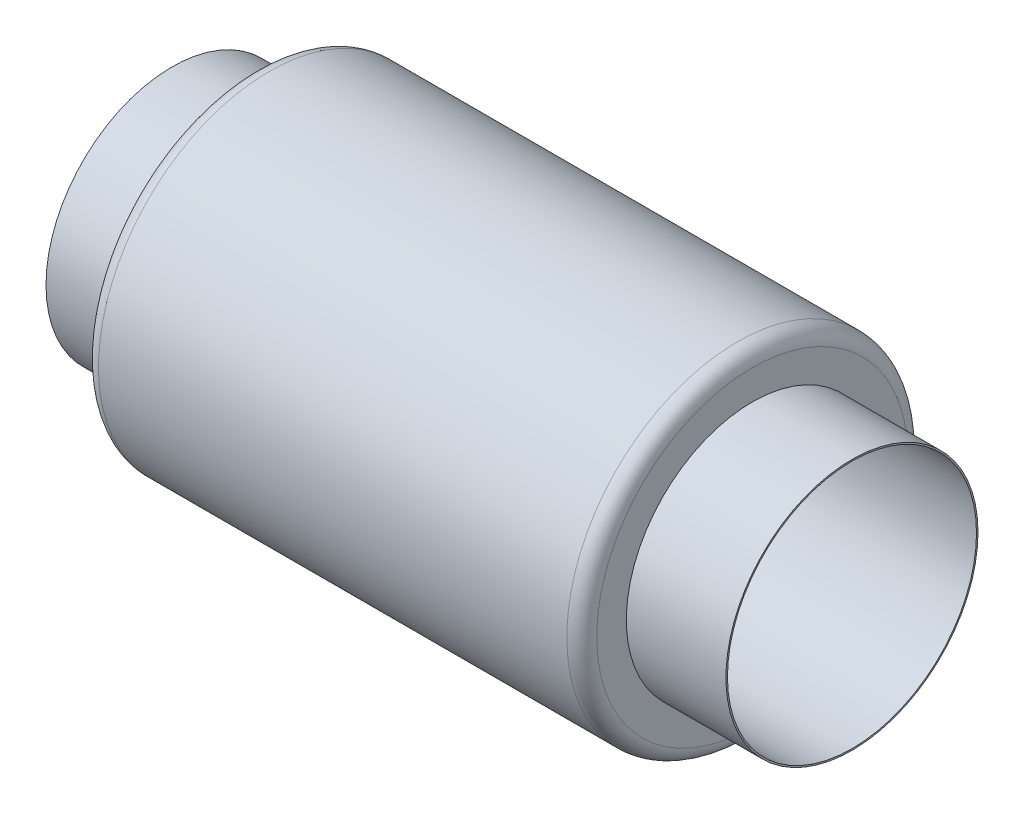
ISO-10303-21;
HEADER;
FILE_DESCRIPTION(('STEP AP214'),'2;1');
FILE_NAME('part.step','',(''),(''),'','','');
FILE_SCHEMA(('AUTOMOTIVE_DESIGN { 1 0 10303 214 1 1 1 1 }'));
ENDSEC;
DATA;
#1=APPLICATION_CONTEXT('core data for automotive mechanical design processes');
#2=APPLICATION_PROTOCOL_DEFINITION('international standard','automotive_design',2000,#1);
#3=PRODUCT_CONTEXT('',#1,'mechanical');
#4=PRODUCT('Part','Part','',(#3));
#5=PRODUCT_RELATED_PRODUCT_CATEGORY('part','',(#4));
#6=PRODUCT_DEFINITION_FORMATION('','',#4);
#7=PRODUCT_DEFINITION_CONTEXT('part definition',#1,'design');
#8=PRODUCT_DEFINITION('design','',#6,#7);
#9=PRODUCT_DEFINITION_SHAPE('','',#8);
#10=(LENGTH_UNIT() NAMED_UNIT(*) SI_UNIT(.MILLI.,.METRE.));
#11=(NAMED_UNIT(*) PLANE_ANGLE_UNIT() SI_UNIT($,.RADIAN.));
#12=(NAMED_UNIT(*) SI_UNIT($,.STERADIAN.) SOLID_ANGLE_UNIT());
#13=UNCERTAINTY_MEASURE_WITH_UNIT(LENGTH_MEASURE(1.E-05),#10,'distance_accuracy_value','');
#14=(GEOMETRIC_REPRESENTATION_CONTEXT(3) GLOBAL_UNCERTAINTY_ASSIGNED_CONTEXT((#13)) GLOBAL_UNIT_ASSIGNED_CONTEXT((#10,
#11,#12)) REPRESENTATION_CONTEXT('',''));
#15=CARTESIAN_POINT('',(0.,0.,0.));
#16=DIRECTION('',(0.,0.,1.));
#17=DIRECTION('',(1.,0.,0.));
#18=AXIS2_PLACEMENT_3D('',#15,#16,#17);
#19=CARTESIAN_POINT('',(88.9,0.,0.));
#20=DIRECTION('',(-1.,0.,0.));
#21=DIRECTION('',(0.,0.,1.));
#22=AXIS2_PLACEMENT_3D('',#19,#20,#21);
#23=CYLINDRICAL_SURFACE('',#22,12.7);
#24=CARTESIAN_POINT('',(10.6679999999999,0.,0.));
#25=DIRECTION('',(-1.,0.,0.));
#26=DIRECTION('',(0.,0.,1.));
#27=AXIS2_PLACEMENT_3D('',#24,#25,#26);
#28=CIRCLE('',#27,12.7);
#29=CARTESIAN_POINT('',(10.6679999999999,0.,12.7));
#30=VERTEX_POINT('',#29);
#31=EDGE_CURVE('E53',#30,#30,#28,.T.);
#32=ORIENTED_EDGE('',*,*,#31,.T.);
#33=EDGE_LOOP('',(#32));
#34=FACE_BOUND('',#33,.T.);
#35=CARTESIAN_POINT('',(80.0099999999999,0.,-2.22044604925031E-13));
#36=DIRECTION('',(1.,0.,0.));
#37=DIRECTION('',(0.,0.,-1.));
#38=AXIS2_PLACEMENT_3D('',#35,#36,#37);
#39=CIRCLE('',#38,12.7);
#40=CARTESIAN_POINT('',(80.0099999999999,0.,-12.7000000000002));
#41=VERTEX_POINT('',#40);
#42=EDGE_CURVE('E56',#41,#41,#39,.T.);
#43=ORIENTED_EDGE('',*,*,#42,.T.);
#44=EDGE_LOOP('',(#43));
#45=FACE_BOUND('',#44,.T.);
#46=ADVANCED_FACE('F37',(#34,#45),#23,.F.);
#47=CARTESIAN_POINT('',(88.9,0.,0.));
#48=DIRECTION('',(-1.,0.,0.));
#49=DIRECTION('',(0.,0.,1.));
#50=AXIS2_PLACEMENT_3D('',#47,#48,#49);
#51=CYLINDRICAL_SURFACE('',#50,12.8524);
#52=CARTESIAN_POINT('',(69.85,0.,-2.22044604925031E-13));
#53=DIRECTION('',(1.,0.,0.));
#54=DIRECTION('',(0.,0.,-1.));
#55=AXIS2_PLACEMENT_3D('',#52,#53,#54);
#56=CIRCLE('',#55,12.8524);
#57=CARTESIAN_POINT('',(69.85,0.,-12.8524000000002));
#58=VERTEX_POINT('',#57);
#59=EDGE_CURVE('E60',#58,#58,#56,.T.);
#60=ORIENTED_EDGE('',*,*,#59,.T.);
#61=EDGE_LOOP('',(#60));
#62=FACE_BOUND('',#61,.T.);
#63=CARTESIAN_POINT('',(80.0099999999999,0.,-2.22044604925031E-13));
#64=DIRECTION('',(1.,0.,0.));
#65=DIRECTION('',(0.,0.,-1.));
#66=AXIS2_PLACEMENT_3D('',#63,#64,#65);
#67=CIRCLE('',#66,12.8524);
#68=CARTESIAN_POINT('',(80.0099999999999,0.,-12.8524000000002));
#69=VERTEX_POINT('',#68);
#70=EDGE_CURVE('E41',#69,#69,#67,.T.);
#71=ORIENTED_EDGE('',*,*,#70,.F.);
#72=EDGE_LOOP('',(#71));
#73=FACE_BOUND('',#72,.T.);
#74=ADVANCED_FACE('F93',(#62,#73),#51,.T.);
#75=CARTESIAN_POINT('',(19.05,0.,0.));
#76=DIRECTION('',(1.,0.,0.));
#77=DIRECTION('',(0.,0.,-1.));
#78=AXIS2_PLACEMENT_3D('',#75,#76,#77);
#79=CIRCLE('',#78,12.8524);
#80=CARTESIAN_POINT('',(19.05,0.,-12.8524));
#81=VERTEX_POINT('',#80);
#82=EDGE_CURVE('E68',#81,#81,#79,.T.);
#83=ORIENTED_EDGE('',*,*,#82,.F.);
#84=EDGE_LOOP('',(#83));
#85=FACE_BOUND('',#84,.T.);
#86=CARTESIAN_POINT('',(10.6679999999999,0.,0.));
#87=DIRECTION('',(-1.,0.,0.));
#88=DIRECTION('',(0.,0.,1.));
#89=AXIS2_PLACEMENT_3D('',#86,#87,#88);
#90=CIRCLE('',#89,12.8524);
#91=CARTESIAN_POINT('',(10.6679999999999,0.,12.8524));
#92=VERTEX_POINT('',#91);
#93=EDGE_CURVE('E55',#92,#92,#90,.T.);
#94=ORIENTED_EDGE('',*,*,#93,.F.);
#95=EDGE_LOOP('',(#94));
#96=FACE_BOUND('',#95,.T.);
#97=ADVANCED_FACE('F98',(#85,#96),#51,.T.);
#98=CARTESIAN_POINT('',(69.85,0.,-2.22044604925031E-13));
#99=DIRECTION('',(1.,0.,0.));
#100=DIRECTION('',(0.,0.,-1.));
#101=AXIS2_PLACEMENT_3D('',#98,#99,#100);
#102=PLANE('',#101);
#103=CARTESIAN_POINT('',(69.85,0.,-2.22044604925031E-13));
#104=DIRECTION('',(1.,0.,0.));
#105=DIRECTION('',(0.,0.,-1.));
#106=AXIS2_PLACEMENT_3D('',#103,#104,#105);
#107=CIRCLE('',#106,15.875);
#108=CARTESIAN_POINT('',(69.85,0.,-15.8750000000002));
#109=VERTEX_POINT('',#108);
#110=EDGE_CURVE('E71',#109,#109,#107,.T.);
#111=ORIENTED_EDGE('',*,*,#110,.T.);
#112=EDGE_LOOP('',(#111));
#113=FACE_BOUND('',#112,.T.);
#114=ORIENTED_EDGE('',*,*,#59,.F.);
#115=EDGE_LOOP('',(#114));
#116=FACE_BOUND('',#115,.T.);
#117=ADVANCED_FACE('F108',(#113,#116),#102,.T.);
#118=CARTESIAN_POINT('',(19.05,0.,0.));
#119=DIRECTION('',(1.,0.,0.));
#120=DIRECTION('',(0.,0.,-1.));
#121=AXIS2_PLACEMENT_3D('',#118,#119,#120);
#122=PLANE('',#121);
#123=CARTESIAN_POINT('',(19.05,0.,0.));
#124=DIRECTION('',(1.,0.,0.));
#125=DIRECTION('',(0.,0.,-1.));
#126=AXIS2_PLACEMENT_3D('',#123,#124,#125);
#127=CIRCLE('',#126,15.875);
#128=CARTESIAN_POINT('',(19.05,0.,-15.875));
#129=VERTEX_POINT('',#128);
#130=EDGE_CURVE('E10',#129,#129,#127,.F.);
#131=ORIENTED_EDGE('',*,*,#130,.T.);
#132=EDGE_LOOP('',(#131));
#133=FACE_BOUND('',#132,.T.);
#134=ORIENTED_EDGE('',*,*,#82,.T.);
#135=EDGE_LOOP('',(#134));
#136=FACE_BOUND('',#135,.T.);
#137=ADVANCED_FACE('F104',(#133,#136),#122,.F.);
#138=CARTESIAN_POINT('',(69.85,0.,-2.22044604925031E-13));
#139=DIRECTION('',(-1.,0.,0.));
#140=DIRECTION('',(0.,0.,1.));
#141=AXIS2_PLACEMENT_3D('',#138,#139,#140);
#142=CYLINDRICAL_SURFACE('',#141,17.399);
#143=CARTESIAN_POINT('',(68.3260000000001,0.,2.22044604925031E-13));
#144=DIRECTION('',(1.,0.,0.));
#145=DIRECTION('',(0.,0.,-1.));
#146=AXIS2_PLACEMENT_3D('',#143,#144,#145);
#147=CIRCLE('',#146,17.399);
#148=CARTESIAN_POINT('',(68.3260000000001,0.,-17.3989999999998));
#149=VERTEX_POINT('',#148);
#150=EDGE_CURVE('E45',#149,#149,#147,.F.);
#151=ORIENTED_EDGE('',*,*,#150,.T.);
#152=EDGE_LOOP('',(#151));
#153=FACE_BOUND('',#152,.T.);
#154=CARTESIAN_POINT('',(20.574,0.,0.));
#155=DIRECTION('',(1.,0.,0.));
#156=DIRECTION('',(0.,0.,-1.));
#157=AXIS2_PLACEMENT_3D('',#154,#155,#156);
#158=CIRCLE('',#157,17.399);
#159=CARTESIAN_POINT('',(20.574,0.,-17.399));
#160=VERTEX_POINT('',#159);
#161=EDGE_CURVE('E50',#160,#160,#158,.T.);
#162=ORIENTED_EDGE('',*,*,#161,.T.);
#163=EDGE_LOOP('',(#162));
#164=FACE_BOUND('',#163,.T.);
#165=ADVANCED_FACE('F78',(#153,#164),#142,.T.);
#166=CARTESIAN_POINT('',(68.3260000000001,0.,2.22044604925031E-13));
#167=DIRECTION('',(1.,0.,0.));
#168=DIRECTION('',(0.,0.,-1.));
#169=AXIS2_PLACEMENT_3D('',#166,#167,#168);
#170=TOROIDAL_SURFACE('',#169,15.875,1.524);
#171=ORIENTED_EDGE('',*,*,#150,.F.);
#172=EDGE_LOOP('',(#171));
#173=FACE_BOUND('',#172,.T.);
#174=ORIENTED_EDGE('',*,*,#110,.F.);
#175=EDGE_LOOP('',(#174));
#176=FACE_BOUND('',#175,.T.);
#177=ADVANCED_FACE('F82',(#173,#176),#170,.T.);
#178=CARTESIAN_POINT('',(20.574,0.,0.));
#179=DIRECTION('',(1.,0.,0.));
#180=DIRECTION('',(0.,0.,-1.));
#181=AXIS2_PLACEMENT_3D('',#178,#179,#180);
#182=TOROIDAL_SURFACE('',#181,15.875,1.524);
#183=ORIENTED_EDGE('',*,*,#130,.F.);
#184=EDGE_LOOP('',(#183));
#185=FACE_BOUND('',#184,.T.);
#186=ORIENTED_EDGE('',*,*,#161,.F.);
#187=EDGE_LOOP('',(#186));
#188=FACE_BOUND('',#187,.T.);
#189=ADVANCED_FACE('F39',(#185,#188),#182,.T.);
#190=CARTESIAN_POINT('',(10.6679999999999,0.,0.));
#191=DIRECTION('',(-1.,0.,0.));
#192=DIRECTION('',(0.,0.,1.));
#193=AXIS2_PLACEMENT_3D('',#190,#191,#192);
#194=PLANE('',#193);
#195=ORIENTED_EDGE('',*,*,#31,.F.);
#196=EDGE_LOOP('',(#195));
#197=FACE_BOUND('',#196,.T.);
#198=ORIENTED_EDGE('',*,*,#93,.T.);
#199=EDGE_LOOP('',(#198));
#200=FACE_BOUND('',#199,.T.);
#201=ADVANCED_FACE('F81',(#197,#200),#194,.T.);
#202=CARTESIAN_POINT('',(80.0099999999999,0.,-2.22044604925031E-13));
#203=DIRECTION('',(1.,0.,0.));
#204=DIRECTION('',(0.,0.,-1.));
#205=AXIS2_PLACEMENT_3D('',#202,#203,#204);
#206=PLANE('',#205);
#207=ORIENTED_EDGE('',*,*,#42,.F.);
#208=EDGE_LOOP('',(#207));
#209=FACE_BOUND('',#208,.T.);
#210=ORIENTED_EDGE('',*,*,#70,.T.);
#211=EDGE_LOOP('',(#210));
#212=FACE_BOUND('',#211,.T.);
#213=ADVANCED_FACE('F88',(#209,#212),#206,.T.);
#214=CLOSED_SHELL('',(#46,#74,#97,#117,#137,#165,#177,#189,#201,#213));
#215=MANIFOLD_SOLID_BREP('B2',#214);
#216=ADVANCED_BREP_SHAPE_REPRESENTATION('',(#18,#215),#14);
#217=SHAPE_DEFINITION_REPRESENTATION(#9,#216);
ENDSEC;
END-ISO-10303-21;
